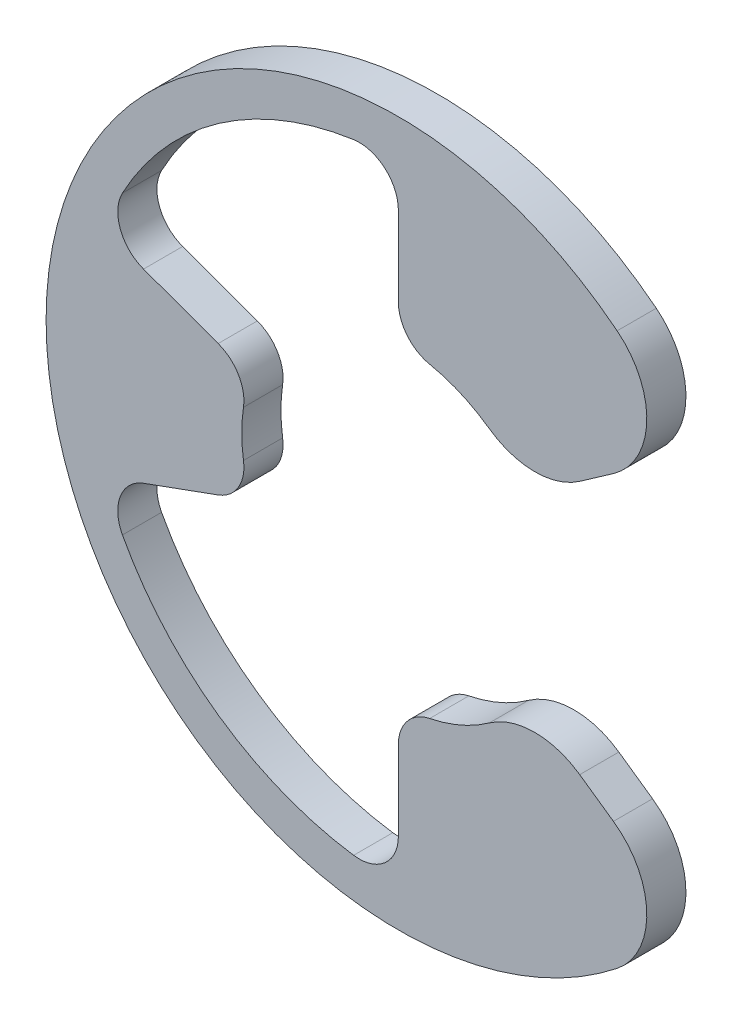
ISO-10303-21;
HEADER;
FILE_DESCRIPTION(('STEP AP214'),'2;1');
FILE_NAME('part.step','',(''),(''),'','','');
FILE_SCHEMA(('AUTOMOTIVE_DESIGN { 1 0 10303 214 1 1 1 1 }'));
ENDSEC;
DATA;
#1=APPLICATION_CONTEXT('core data for automotive mechanical design processes');
#2=APPLICATION_PROTOCOL_DEFINITION('international standard','automotive_design',2000,#1);
#3=PRODUCT_CONTEXT('',#1,'mechanical');
#4=PRODUCT('Part','Part','',(#3));
#5=PRODUCT_RELATED_PRODUCT_CATEGORY('part','',(#4));
#6=PRODUCT_DEFINITION_FORMATION('','',#4);
#7=PRODUCT_DEFINITION_CONTEXT('part definition',#1,'design');
#8=PRODUCT_DEFINITION('design','',#6,#7);
#9=PRODUCT_DEFINITION_SHAPE('','',#8);
#10=(LENGTH_UNIT() NAMED_UNIT(*) SI_UNIT(.MILLI.,.METRE.));
#11=(NAMED_UNIT(*) PLANE_ANGLE_UNIT() SI_UNIT($,.RADIAN.));
#12=(NAMED_UNIT(*) SI_UNIT($,.STERADIAN.) SOLID_ANGLE_UNIT());
#13=UNCERTAINTY_MEASURE_WITH_UNIT(LENGTH_MEASURE(1.E-05),#10,'distance_accuracy_value','');
#14=(GEOMETRIC_REPRESENTATION_CONTEXT(3) GLOBAL_UNCERTAINTY_ASSIGNED_CONTEXT((#13)) GLOBAL_UNIT_ASSIGNED_CONTEXT((#10,
#11,#12)) REPRESENTATION_CONTEXT('',''));
#15=CARTESIAN_POINT('',(0.,0.,0.));
#16=DIRECTION('',(0.,0.,1.));
#17=DIRECTION('',(1.,0.,0.));
#18=AXIS2_PLACEMENT_3D('',#15,#16,#17);
#19=CARTESIAN_POINT('',(-3.08418065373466,1.65463884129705,0.5));
#20=DIRECTION('',(0.,0.,-1.));
#21=DIRECTION('',(-1.,0.,0.));
#22=AXIS2_PLACEMENT_3D('',#19,#20,#21);
#23=CYLINDRICAL_SURFACE('',#22,0.5);
#24=CARTESIAN_POINT('',(-3.08418065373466,1.65463884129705,0.));
#25=DIRECTION('',(0.,0.,-1.));
#26=DIRECTION('',(1.,0.,0.));
#27=AXIS2_PLACEMENT_3D('',#24,#25,#26);
#28=CIRCLE('',#27,0.5);
#29=CARTESIAN_POINT('',(-3.25519072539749,1.1847925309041,0.));
#30=VERTEX_POINT('',#29);
#31=CARTESIAN_POINT('',(-3.52477788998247,1.8910158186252,0.));
#32=VERTEX_POINT('',#31);
#33=EDGE_CURVE('E188',#30,#32,#28,.T.);
#34=ORIENTED_EDGE('',*,*,#33,.T.);
#35=DIRECTION('',(0.,0.,-1.));
#36=VECTOR('',#35,1.);
#37=CARTESIAN_POINT('',(-3.52477788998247,1.8910158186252,0.5));
#38=LINE('',#37,#36);
#39=CARTESIAN_POINT('',(-3.52477788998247,1.8910158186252,0.5));
#40=VERTEX_POINT('',#39);
#41=EDGE_CURVE('E11',#40,#32,#38,.T.);
#42=ORIENTED_EDGE('',*,*,#41,.F.);
#43=CARTESIAN_POINT('',(-3.08418065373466,1.65463884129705,0.5));
#44=DIRECTION('',(0.,0.,-1.));
#45=DIRECTION('',(1.,0.,0.));
#46=AXIS2_PLACEMENT_3D('',#43,#44,#45);
#47=CIRCLE('',#46,0.5);
#48=CARTESIAN_POINT('',(-3.25519072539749,1.1847925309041,0.5));
#49=VERTEX_POINT('',#48);
#50=EDGE_CURVE('E247',#49,#40,#47,.T.);
#51=ORIENTED_EDGE('',*,*,#50,.F.);
#52=DIRECTION('',(0.,0.,-1.));
#53=VECTOR('',#52,1.);
#54=CARTESIAN_POINT('',(-3.25519072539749,1.1847925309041,0.5));
#55=LINE('',#54,#53);
#56=EDGE_CURVE('E201',#49,#30,#55,.T.);
#57=ORIENTED_EDGE('',*,*,#56,.T.);
#58=EDGE_LOOP('',(#34,#42,#51,#57));
#59=FACE_BOUND('',#58,.T.);
#60=ADVANCED_FACE('F24',(#59),#23,.F.);
#61=CARTESIAN_POINT('',(0.,0.,0.5));
#62=DIRECTION('',(0.,0.,-1.));
#63=DIRECTION('',(-1.,0.,0.));
#64=AXIS2_PLACEMENT_3D('',#61,#62,#63);
#65=CYLINDRICAL_SURFACE('',#64,4.);
#66=CARTESIAN_POINT('',(0.,0.,0.));
#67=DIRECTION('',(0.,0.,-1.));
#68=DIRECTION('',(1.,0.,0.));
#69=AXIS2_PLACEMENT_3D('',#66,#67,#68);
#70=CIRCLE('',#69,4.);
#71=CARTESIAN_POINT('',(-0.571428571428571,3.95897327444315,0.));
#72=VERTEX_POINT('',#71);
#73=EDGE_CURVE('E184',#32,#72,#70,.T.);
#74=ORIENTED_EDGE('',*,*,#73,.T.);
#75=DIRECTION('',(0.,0.,-1.));
#76=VECTOR('',#75,1.);
#77=CARTESIAN_POINT('',(-0.571428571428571,3.95897327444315,0.5));
#78=LINE('',#77,#76);
#79=CARTESIAN_POINT('',(-0.571428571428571,3.95897327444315,0.5));
#80=VERTEX_POINT('',#79);
#81=EDGE_CURVE('E31',#80,#72,#78,.T.);
#82=ORIENTED_EDGE('',*,*,#81,.F.);
#83=CARTESIAN_POINT('',(0.,0.,0.5));
#84=DIRECTION('',(0.,0.,-1.));
#85=DIRECTION('',(1.,0.,0.));
#86=AXIS2_PLACEMENT_3D('',#83,#84,#85);
#87=CIRCLE('',#86,4.);
#88=EDGE_CURVE('E197',#40,#80,#87,.T.);
#89=ORIENTED_EDGE('',*,*,#88,.F.);
#90=ORIENTED_EDGE('',*,*,#41,.T.);
#91=EDGE_LOOP('',(#74,#82,#89,#90));
#92=FACE_BOUND('',#91,.T.);
#93=ADVANCED_FACE('F196',(#92),#65,.F.);
#94=CARTESIAN_POINT('',(-0.5,3.46410161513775,0.5));
#95=DIRECTION('',(0.,0.,-1.));
#96=DIRECTION('',(-1.,0.,0.));
#97=AXIS2_PLACEMENT_3D('',#94,#95,#96);
#98=CYLINDRICAL_SURFACE('',#97,0.5);
#99=CARTESIAN_POINT('',(-0.5,3.46410161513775,0.));
#100=DIRECTION('',(0.,0.,-1.));
#101=DIRECTION('',(-1.,0.,0.));
#102=AXIS2_PLACEMENT_3D('',#99,#100,#101);
#103=CIRCLE('',#102,0.5);
#104=CARTESIAN_POINT('',(0.,3.46410161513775,0.));
#105=VERTEX_POINT('',#104);
#106=EDGE_CURVE('E190',#72,#105,#103,.T.);
#107=ORIENTED_EDGE('',*,*,#106,.T.);
#108=DIRECTION('',(0.,0.,-1.));
#109=VECTOR('',#108,1.);
#110=CARTESIAN_POINT('',(0.,3.46410161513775,0.5));
#111=LINE('',#110,#109);
#112=CARTESIAN_POINT('',(0.,3.46410161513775,0.5));
#113=VERTEX_POINT('',#112);
#114=EDGE_CURVE('E353',#113,#105,#111,.T.);
#115=ORIENTED_EDGE('',*,*,#114,.F.);
#116=CARTESIAN_POINT('',(-0.5,3.46410161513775,0.5));
#117=DIRECTION('',(0.,0.,-1.));
#118=DIRECTION('',(-1.,0.,0.));
#119=AXIS2_PLACEMENT_3D('',#116,#117,#118);
#120=CIRCLE('',#119,0.5);
#121=EDGE_CURVE('E250',#80,#113,#120,.T.);
#122=ORIENTED_EDGE('',*,*,#121,.F.);
#123=ORIENTED_EDGE('',*,*,#81,.T.);
#124=EDGE_LOOP('',(#107,#115,#122,#123));
#125=FACE_BOUND('',#124,.T.);
#126=ADVANCED_FACE('F357',(#125),#98,.F.);
#127=CARTESIAN_POINT('',(0.,3.46410161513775,0.5));
#128=DIRECTION('',(1.,0.,0.));
#129=DIRECTION('',(0.,0.,-1.));
#130=AXIS2_PLACEMENT_3D('',#127,#128,#129);
#131=PLANE('',#130);
#132=DIRECTION('',(0.,-1.,0.));
#133=VECTOR('',#132,1.);
#134=CARTESIAN_POINT('',(0.,3.46410161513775,0.));
#135=LINE('',#134,#133);
#136=CARTESIAN_POINT('',(0.,2.44948974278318,0.));
#137=VERTEX_POINT('',#136);
#138=EDGE_CURVE('E205',#105,#137,#135,.T.);
#139=ORIENTED_EDGE('',*,*,#138,.T.);
#140=DIRECTION('',(0.,0.,-1.));
#141=VECTOR('',#140,1.);
#142=CARTESIAN_POINT('',(0.,2.44948974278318,0.5));
#143=LINE('',#142,#141);
#144=CARTESIAN_POINT('',(0.,2.44948974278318,0.5));
#145=VERTEX_POINT('',#144);
#146=EDGE_CURVE('E350',#145,#137,#143,.T.);
#147=ORIENTED_EDGE('',*,*,#146,.F.);
#148=DIRECTION('',(0.,-1.,0.));
#149=VECTOR('',#148,1.);
#150=CARTESIAN_POINT('',(0.,3.46410161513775,0.5));
#151=LINE('',#150,#149);
#152=EDGE_CURVE('E252',#113,#145,#151,.T.);
#153=ORIENTED_EDGE('',*,*,#152,.F.);
#154=ORIENTED_EDGE('',*,*,#114,.T.);
#155=EDGE_LOOP('',(#139,#147,#153,#154));
#156=FACE_BOUND('',#155,.T.);
#157=ADVANCED_FACE('F365',(#156),#131,.F.);
#158=CARTESIAN_POINT('',(0.5,2.44948974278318,0.5));
#159=DIRECTION('',(0.,0.,-1.));
#160=DIRECTION('',(-1.,0.,0.));
#161=AXIS2_PLACEMENT_3D('',#158,#159,#160);
#162=CYLINDRICAL_SURFACE('',#161,0.5);
#163=CARTESIAN_POINT('',(0.5,2.44948974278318,0.));
#164=DIRECTION('',(0.,0.,1.));
#165=DIRECTION('',(-1.,0.,0.));
#166=AXIS2_PLACEMENT_3D('',#163,#164,#165);
#167=CIRCLE('',#166,0.5);
#168=CARTESIAN_POINT('',(0.4,1.95959179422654,0.));
#169=VERTEX_POINT('',#168);
#170=EDGE_CURVE('E207',#137,#169,#167,.T.);
#171=ORIENTED_EDGE('',*,*,#170,.T.);
#172=DIRECTION('',(0.,0.,-1.));
#173=VECTOR('',#172,1.);
#174=CARTESIAN_POINT('',(0.4,1.95959179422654,0.5));
#175=LINE('',#174,#173);
#176=CARTESIAN_POINT('',(0.4,1.95959179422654,0.5));
#177=VERTEX_POINT('',#176);
#178=EDGE_CURVE('E347',#177,#169,#175,.T.);
#179=ORIENTED_EDGE('',*,*,#178,.F.);
#180=CARTESIAN_POINT('',(0.5,2.44948974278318,0.5));
#181=DIRECTION('',(0.,0.,1.));
#182=DIRECTION('',(-1.,0.,0.));
#183=AXIS2_PLACEMENT_3D('',#180,#181,#182);
#184=CIRCLE('',#183,0.5);
#185=EDGE_CURVE('E254',#145,#177,#184,.T.);
#186=ORIENTED_EDGE('',*,*,#185,.F.);
#187=ORIENTED_EDGE('',*,*,#146,.T.);
#188=EDGE_LOOP('',(#171,#179,#186,#187));
#189=FACE_BOUND('',#188,.T.);
#190=ADVANCED_FACE('F368',(#189),#162,.T.);
#191=CARTESIAN_POINT('',(0.,0.,0.5));
#192=DIRECTION('',(0.,0.,-1.));
#193=DIRECTION('',(-1.,0.,0.));
#194=AXIS2_PLACEMENT_3D('',#191,#192,#193);
#195=CYLINDRICAL_SURFACE('',#194,2.);
#196=CARTESIAN_POINT('',(0.,0.,0.));
#197=DIRECTION('',(0.,0.,-1.));
#198=DIRECTION('',(1.,0.,0.));
#199=AXIS2_PLACEMENT_3D('',#196,#197,#198);
#200=CIRCLE('',#199,2.);
#201=CARTESIAN_POINT('',(1.1622236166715,1.62764746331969,0.));
#202=VERTEX_POINT('',#201);
#203=EDGE_CURVE('E209',#169,#202,#200,.T.);
#204=ORIENTED_EDGE('',*,*,#203,.T.);
#205=DIRECTION('',(0.,0.,-1.));
#206=VECTOR('',#205,1.);
#207=CARTESIAN_POINT('',(1.1622236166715,1.62764746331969,0.5));
#208=LINE('',#207,#206);
#209=CARTESIAN_POINT('',(1.1622236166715,1.62764746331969,0.5));
#210=VERTEX_POINT('',#209);
#211=EDGE_CURVE('E344',#210,#202,#208,.T.);
#212=ORIENTED_EDGE('',*,*,#211,.F.);
#213=CARTESIAN_POINT('',(0.,0.,0.5));
#214=DIRECTION('',(0.,0.,-1.));
#215=DIRECTION('',(1.,0.,0.));
#216=AXIS2_PLACEMENT_3D('',#213,#214,#215);
#217=CIRCLE('',#216,2.);
#218=EDGE_CURVE('E256',#177,#210,#217,.T.);
#219=ORIENTED_EDGE('',*,*,#218,.F.);
#220=ORIENTED_EDGE('',*,*,#178,.T.);
#221=EDGE_LOOP('',(#204,#212,#219,#220));
#222=FACE_BOUND('',#221,.T.);
#223=ADVANCED_FACE('F373',(#222),#195,.F.);
#224=CARTESIAN_POINT('',(1.74333542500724,2.44147119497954,0.5));
#225=DIRECTION('',(0.,0.,-1.));
#226=DIRECTION('',(-1.,0.,0.));
#227=AXIS2_PLACEMENT_3D('',#224,#225,#226);
#228=CYLINDRICAL_SURFACE('',#227,1.);
#229=CARTESIAN_POINT('',(1.74333542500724,2.44147119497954,0.));
#230=DIRECTION('',(0.,0.,1.));
#231=DIRECTION('',(1.,0.,0.));
#232=AXIS2_PLACEMENT_3D('',#229,#230,#231);
#233=CIRCLE('',#232,1.);
#234=CARTESIAN_POINT('',(2.31691186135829,1.62231915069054,0.));
#235=VERTEX_POINT('',#234);
#236=EDGE_CURVE('E211',#202,#235,#233,.T.);
#237=ORIENTED_EDGE('',*,*,#236,.T.);
#238=DIRECTION('',(0.,0.,-1.));
#239=VECTOR('',#238,1.);
#240=CARTESIAN_POINT('',(2.31691186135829,1.62231915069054,0.5));
#241=LINE('',#240,#239);
#242=CARTESIAN_POINT('',(2.31691186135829,1.62231915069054,0.5));
#243=VERTEX_POINT('',#242);
#244=EDGE_CURVE('E341',#243,#235,#241,.T.);
#245=ORIENTED_EDGE('',*,*,#244,.F.);
#246=CARTESIAN_POINT('',(1.74333542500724,2.44147119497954,0.5));
#247=DIRECTION('',(0.,0.,1.));
#248=DIRECTION('',(1.,0.,0.));
#249=AXIS2_PLACEMENT_3D('',#246,#247,#248);
#250=CIRCLE('',#249,1.);
#251=EDGE_CURVE('E258',#210,#243,#250,.T.);
#252=ORIENTED_EDGE('',*,*,#251,.F.);
#253=ORIENTED_EDGE('',*,*,#211,.T.);
#254=EDGE_LOOP('',(#237,#245,#252,#253));
#255=FACE_BOUND('',#254,.T.);
#256=ADVANCED_FACE('F379',(#255),#228,.T.);
#257=CARTESIAN_POINT('',(2.31691186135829,1.62231915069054,0.5));
#258=DIRECTION('',(-0.573576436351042,0.819152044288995,0.));
#259=DIRECTION('',(-0.819152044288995,-0.573576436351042,0.));
#260=AXIS2_PLACEMENT_3D('',#257,#258,#259);
#261=PLANE('',#260);
#262=DIRECTION('',(0.819152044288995,0.573576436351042,0.));
#263=VECTOR('',#262,1.);
#264=CARTESIAN_POINT('',(2.31691186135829,1.62231915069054,0.));
#265=LINE('',#264,#263);
#266=CARTESIAN_POINT('',(2.74751948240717,1.92383385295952,0.));
#267=VERTEX_POINT('',#266);
#268=EDGE_CURVE('E213',#235,#267,#265,.T.);
#269=ORIENTED_EDGE('',*,*,#268,.T.);
#270=DIRECTION('',(0.,0.,-1.));
#271=VECTOR('',#270,1.);
#272=CARTESIAN_POINT('',(2.74751948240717,1.92383385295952,0.5));
#273=LINE('',#272,#271);
#274=CARTESIAN_POINT('',(2.74751948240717,1.92383385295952,0.5));
#275=VERTEX_POINT('',#274);
#276=EDGE_CURVE('E338',#275,#267,#273,.T.);
#277=ORIENTED_EDGE('',*,*,#276,.F.);
#278=DIRECTION('',(0.819152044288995,0.573576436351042,0.));
#279=VECTOR('',#278,1.);
#280=CARTESIAN_POINT('',(2.31691186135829,1.62231915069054,0.5));
#281=LINE('',#280,#279);
#282=EDGE_CURVE('E260',#243,#275,#281,.T.);
#283=ORIENTED_EDGE('',*,*,#282,.F.);
#284=ORIENTED_EDGE('',*,*,#244,.T.);
#285=EDGE_LOOP('',(#269,#277,#283,#284));
#286=FACE_BOUND('',#285,.T.);
#287=ADVANCED_FACE('F383',(#286),#261,.F.);
#288=CARTESIAN_POINT('',(2.17394304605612,2.74298589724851,0.5));
#289=DIRECTION('',(0.,0.,-1.));
#290=DIRECTION('',(-1.,0.,0.));
#291=AXIS2_PLACEMENT_3D('',#288,#289,#290);
#292=CYLINDRICAL_SURFACE('',#291,1.);
#293=CARTESIAN_POINT('',(2.17394304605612,2.74298589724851,0.));
#294=DIRECTION('',(0.,0.,1.));
#295=DIRECTION('',(-1.,0.,0.));
#296=AXIS2_PLACEMENT_3D('',#293,#294,#295);
#297=CIRCLE('',#296,1.);
#298=CARTESIAN_POINT('',(2.79506963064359,3.52669615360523,0.));
#299=VERTEX_POINT('',#298);
#300=EDGE_CURVE('E215',#267,#299,#297,.T.);
#301=ORIENTED_EDGE('',*,*,#300,.T.);
#302=DIRECTION('',(0.,0.,-1.));
#303=VECTOR('',#302,1.);
#304=CARTESIAN_POINT('',(2.79506963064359,3.52669615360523,0.5));
#305=LINE('',#304,#303);
#306=CARTESIAN_POINT('',(2.79506963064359,3.52669615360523,0.5));
#307=VERTEX_POINT('',#306);
#308=EDGE_CURVE('E335',#307,#299,#305,.T.);
#309=ORIENTED_EDGE('',*,*,#308,.F.);
#310=CARTESIAN_POINT('',(2.17394304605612,2.74298589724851,0.5));
#311=DIRECTION('',(0.,0.,1.));
#312=DIRECTION('',(-1.,0.,0.));
#313=AXIS2_PLACEMENT_3D('',#310,#311,#312);
#314=CIRCLE('',#313,1.);
#315=EDGE_CURVE('E262',#275,#307,#314,.T.);
#316=ORIENTED_EDGE('',*,*,#315,.F.);
#317=ORIENTED_EDGE('',*,*,#276,.T.);
#318=EDGE_LOOP('',(#301,#309,#316,#317));
#319=FACE_BOUND('',#318,.T.);
#320=ADVANCED_FACE('F388',(#319),#292,.T.);
#321=CARTESIAN_POINT('',(0.,0.,0.5));
#322=DIRECTION('',(0.,0.,-1.));
#323=DIRECTION('',(-1.,0.,0.));
#324=AXIS2_PLACEMENT_3D('',#321,#322,#323);
#325=CYLINDRICAL_SURFACE('',#324,4.5);
#326=CARTESIAN_POINT('',(0.,0.,0.));
#327=DIRECTION('',(0.,0.,1.));
#328=DIRECTION('',(1.,0.,0.));
#329=AXIS2_PLACEMENT_3D('',#326,#327,#328);
#330=CIRCLE('',#329,4.5);
#331=CARTESIAN_POINT('',(2.79506963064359,-3.52669615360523,0.));
#332=VERTEX_POINT('',#331);
#333=EDGE_CURVE('E217',#299,#332,#330,.T.);
#334=ORIENTED_EDGE('',*,*,#333,.T.);
#335=DIRECTION('',(0.,0.,-1.));
#336=VECTOR('',#335,1.);
#337=CARTESIAN_POINT('',(2.79506963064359,-3.52669615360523,0.5));
#338=LINE('',#337,#336);
#339=CARTESIAN_POINT('',(2.79506963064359,-3.52669615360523,0.5));
#340=VERTEX_POINT('',#339);
#341=EDGE_CURVE('E332',#340,#332,#338,.T.);
#342=ORIENTED_EDGE('',*,*,#341,.F.);
#343=CARTESIAN_POINT('',(0.,0.,0.5));
#344=DIRECTION('',(0.,0.,1.));
#345=DIRECTION('',(1.,0.,0.));
#346=AXIS2_PLACEMENT_3D('',#343,#344,#345);
#347=CIRCLE('',#346,4.5);
#348=EDGE_CURVE('E264',#307,#340,#347,.T.);
#349=ORIENTED_EDGE('',*,*,#348,.F.);
#350=ORIENTED_EDGE('',*,*,#308,.T.);
#351=EDGE_LOOP('',(#334,#342,#349,#350));
#352=FACE_BOUND('',#351,.T.);
#353=ADVANCED_FACE('F394',(#352),#325,.T.);
#354=CARTESIAN_POINT('',(2.17394304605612,-2.74298589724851,0.5));
#355=DIRECTION('',(0.,0.,-1.));
#356=DIRECTION('',(-1.,0.,0.));
#357=AXIS2_PLACEMENT_3D('',#354,#355,#356);
#358=CYLINDRICAL_SURFACE('',#357,1.);
#359=CARTESIAN_POINT('',(2.17394304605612,-2.74298589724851,0.));
#360=DIRECTION('',(0.,0.,1.));
#361=DIRECTION('',(1.,0.,0.));
#362=AXIS2_PLACEMENT_3D('',#359,#360,#361);
#363=CIRCLE('',#362,1.);
#364=CARTESIAN_POINT('',(2.74751948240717,-1.92383385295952,0.));
#365=VERTEX_POINT('',#364);
#366=EDGE_CURVE('E219',#332,#365,#363,.T.);
#367=ORIENTED_EDGE('',*,*,#366,.T.);
#368=DIRECTION('',(0.,0.,-1.));
#369=VECTOR('',#368,1.);
#370=CARTESIAN_POINT('',(2.74751948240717,-1.92383385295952,0.5));
#371=LINE('',#370,#369);
#372=CARTESIAN_POINT('',(2.74751948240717,-1.92383385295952,0.5));
#373=VERTEX_POINT('',#372);
#374=EDGE_CURVE('E329',#373,#365,#371,.T.);
#375=ORIENTED_EDGE('',*,*,#374,.F.);
#376=CARTESIAN_POINT('',(2.17394304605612,-2.74298589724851,0.5));
#377=DIRECTION('',(0.,0.,1.));
#378=DIRECTION('',(1.,0.,0.));
#379=AXIS2_PLACEMENT_3D('',#376,#377,#378);
#380=CIRCLE('',#379,1.);
#381=EDGE_CURVE('E266',#340,#373,#380,.T.);
#382=ORIENTED_EDGE('',*,*,#381,.F.);
#383=ORIENTED_EDGE('',*,*,#341,.T.);
#384=EDGE_LOOP('',(#367,#375,#382,#383));
#385=FACE_BOUND('',#384,.T.);
#386=ADVANCED_FACE('F398',(#385),#358,.T.);
#387=CARTESIAN_POINT('',(2.31691186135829,-1.62231915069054,0.5));
#388=DIRECTION('',(-0.573576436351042,-0.819152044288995,0.));
#389=DIRECTION('',(0.819152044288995,-0.573576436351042,0.));
#390=AXIS2_PLACEMENT_3D('',#387,#388,#389);
#391=PLANE('',#390);
#392=DIRECTION('',(-0.819152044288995,0.573576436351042,0.));
#393=VECTOR('',#392,1.);
#394=CARTESIAN_POINT('',(2.31691186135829,-1.62231915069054,0.));
#395=LINE('',#394,#393);
#396=CARTESIAN_POINT('',(2.31691186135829,-1.62231915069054,0.));
#397=VERTEX_POINT('',#396);
#398=EDGE_CURVE('E221',#365,#397,#395,.T.);
#399=ORIENTED_EDGE('',*,*,#398,.T.);
#400=DIRECTION('',(0.,0.,-1.));
#401=VECTOR('',#400,1.);
#402=CARTESIAN_POINT('',(2.31691186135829,-1.62231915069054,0.5));
#403=LINE('',#402,#401);
#404=CARTESIAN_POINT('',(2.31691186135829,-1.62231915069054,0.5));
#405=VERTEX_POINT('',#404);
#406=EDGE_CURVE('E326',#405,#397,#403,.T.);
#407=ORIENTED_EDGE('',*,*,#406,.F.);
#408=DIRECTION('',(-0.819152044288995,0.573576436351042,0.));
#409=VECTOR('',#408,1.);
#410=CARTESIAN_POINT('',(2.31691186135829,-1.62231915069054,0.5));
#411=LINE('',#410,#409);
#412=EDGE_CURVE('E268',#373,#405,#411,.T.);
#413=ORIENTED_EDGE('',*,*,#412,.F.);
#414=ORIENTED_EDGE('',*,*,#374,.T.);
#415=EDGE_LOOP('',(#399,#407,#413,#414));
#416=FACE_BOUND('',#415,.T.);
#417=ADVANCED_FACE('F403',(#416),#391,.F.);
#418=CARTESIAN_POINT('',(1.74333542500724,-2.44147119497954,0.5));
#419=DIRECTION('',(0.,0.,-1.));
#420=DIRECTION('',(-1.,0.,0.));
#421=AXIS2_PLACEMENT_3D('',#418,#419,#420);
#422=CYLINDRICAL_SURFACE('',#421,1.);
#423=CARTESIAN_POINT('',(1.74333542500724,-2.44147119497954,0.));
#424=DIRECTION('',(0.,0.,1.));
#425=DIRECTION('',(-1.,0.,0.));
#426=AXIS2_PLACEMENT_3D('',#423,#424,#425);
#427=CIRCLE('',#426,1.);
#428=CARTESIAN_POINT('',(1.1622236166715,-1.62764746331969,0.));
#429=VERTEX_POINT('',#428);
#430=EDGE_CURVE('E223',#397,#429,#427,.T.);
#431=ORIENTED_EDGE('',*,*,#430,.T.);
#432=DIRECTION('',(0.,0.,-1.));
#433=VECTOR('',#432,1.);
#434=CARTESIAN_POINT('',(1.1622236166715,-1.62764746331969,0.5));
#435=LINE('',#434,#433);
#436=CARTESIAN_POINT('',(1.1622236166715,-1.62764746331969,0.5));
#437=VERTEX_POINT('',#436);
#438=EDGE_CURVE('E323',#437,#429,#435,.T.);
#439=ORIENTED_EDGE('',*,*,#438,.F.);
#440=CARTESIAN_POINT('',(1.74333542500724,-2.44147119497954,0.5));
#441=DIRECTION('',(0.,0.,1.));
#442=DIRECTION('',(-1.,0.,0.));
#443=AXIS2_PLACEMENT_3D('',#440,#441,#442);
#444=CIRCLE('',#443,1.);
#445=EDGE_CURVE('E270',#405,#437,#444,.T.);
#446=ORIENTED_EDGE('',*,*,#445,.F.);
#447=ORIENTED_EDGE('',*,*,#406,.T.);
#448=EDGE_LOOP('',(#431,#439,#446,#447));
#449=FACE_BOUND('',#448,.T.);
#450=ADVANCED_FACE('F409',(#449),#422,.T.);
#451=CARTESIAN_POINT('',(0.,0.,0.5));
#452=DIRECTION('',(0.,0.,-1.));
#453=DIRECTION('',(-1.,0.,0.));
#454=AXIS2_PLACEMENT_3D('',#451,#452,#453);
#455=CYLINDRICAL_SURFACE('',#454,2.);
#456=CARTESIAN_POINT('',(0.,0.,0.));
#457=DIRECTION('',(0.,0.,-1.));
#458=DIRECTION('',(1.,0.,0.));
#459=AXIS2_PLACEMENT_3D('',#456,#457,#458);
#460=CIRCLE('',#459,2.);
#461=CARTESIAN_POINT('',(0.399999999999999,-1.95959179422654,0.));
#462=VERTEX_POINT('',#461);
#463=EDGE_CURVE('E225',#429,#462,#460,.T.);
#464=ORIENTED_EDGE('',*,*,#463,.T.);
#465=DIRECTION('',(0.,0.,-1.));
#466=VECTOR('',#465,1.);
#467=CARTESIAN_POINT('',(0.399999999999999,-1.95959179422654,0.5));
#468=LINE('',#467,#466);
#469=CARTESIAN_POINT('',(0.399999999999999,-1.95959179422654,0.5));
#470=VERTEX_POINT('',#469);
#471=EDGE_CURVE('E320',#470,#462,#468,.T.);
#472=ORIENTED_EDGE('',*,*,#471,.F.);
#473=CARTESIAN_POINT('',(0.,0.,0.5));
#474=DIRECTION('',(0.,0.,-1.));
#475=DIRECTION('',(1.,0.,0.));
#476=AXIS2_PLACEMENT_3D('',#473,#474,#475);
#477=CIRCLE('',#476,2.);
#478=EDGE_CURVE('E272',#437,#470,#477,.T.);
#479=ORIENTED_EDGE('',*,*,#478,.F.);
#480=ORIENTED_EDGE('',*,*,#438,.T.);
#481=EDGE_LOOP('',(#464,#472,#479,#480));
#482=FACE_BOUND('',#481,.T.);
#483=ADVANCED_FACE('F413',(#482),#455,.F.);
#484=CARTESIAN_POINT('',(0.5,-2.44948974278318,0.5));
#485=DIRECTION('',(0.,0.,-1.));
#486=DIRECTION('',(-1.,0.,0.));
#487=AXIS2_PLACEMENT_3D('',#484,#485,#486);
#488=CYLINDRICAL_SURFACE('',#487,0.5);
#489=CARTESIAN_POINT('',(0.5,-2.44948974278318,0.));
#490=DIRECTION('',(0.,0.,1.));
#491=DIRECTION('',(1.,0.,0.));
#492=AXIS2_PLACEMENT_3D('',#489,#490,#491);
#493=CIRCLE('',#492,0.5);
#494=CARTESIAN_POINT('',(0.,-2.44948974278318,0.));
#495=VERTEX_POINT('',#494);
#496=EDGE_CURVE('E227',#462,#495,#493,.T.);
#497=ORIENTED_EDGE('',*,*,#496,.T.);
#498=DIRECTION('',(0.,0.,-1.));
#499=VECTOR('',#498,1.);
#500=CARTESIAN_POINT('',(0.,-2.44948974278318,0.5));
#501=LINE('',#500,#499);
#502=CARTESIAN_POINT('',(0.,-2.44948974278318,0.5));
#503=VERTEX_POINT('',#502);
#504=EDGE_CURVE('E317',#503,#495,#501,.T.);
#505=ORIENTED_EDGE('',*,*,#504,.F.);
#506=CARTESIAN_POINT('',(0.5,-2.44948974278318,0.5));
#507=DIRECTION('',(0.,0.,1.));
#508=DIRECTION('',(1.,0.,0.));
#509=AXIS2_PLACEMENT_3D('',#506,#507,#508);
#510=CIRCLE('',#509,0.5);
#511=EDGE_CURVE('E274',#470,#503,#510,.T.);
#512=ORIENTED_EDGE('',*,*,#511,.F.);
#513=ORIENTED_EDGE('',*,*,#471,.T.);
#514=EDGE_LOOP('',(#497,#505,#512,#513));
#515=FACE_BOUND('',#514,.T.);
#516=ADVANCED_FACE('F418',(#515),#488,.T.);
#517=CARTESIAN_POINT('',(0.,-3.46410161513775,0.5));
#518=DIRECTION('',(1.,0.,0.));
#519=DIRECTION('',(0.,0.,-1.));
#520=AXIS2_PLACEMENT_3D('',#517,#518,#519);
#521=PLANE('',#520);
#522=DIRECTION('',(0.,-1.,0.));
#523=VECTOR('',#522,1.);
#524=CARTESIAN_POINT('',(0.,-3.46410161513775,0.));
#525=LINE('',#524,#523);
#526=CARTESIAN_POINT('',(0.,-3.46410161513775,0.));
#527=VERTEX_POINT('',#526);
#528=EDGE_CURVE('E229',#495,#527,#525,.T.);
#529=ORIENTED_EDGE('',*,*,#528,.T.);
#530=DIRECTION('',(0.,0.,-1.));
#531=VECTOR('',#530,1.);
#532=CARTESIAN_POINT('',(0.,-3.46410161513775,0.5));
#533=LINE('',#532,#531);
#534=CARTESIAN_POINT('',(0.,-3.46410161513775,0.5));
#535=VERTEX_POINT('',#534);
#536=EDGE_CURVE('E314',#535,#527,#533,.T.);
#537=ORIENTED_EDGE('',*,*,#536,.F.);
#538=DIRECTION('',(0.,-1.,0.));
#539=VECTOR('',#538,1.);
#540=CARTESIAN_POINT('',(0.,-3.46410161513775,0.5));
#541=LINE('',#540,#539);
#542=EDGE_CURVE('E276',#503,#535,#541,.T.);
#543=ORIENTED_EDGE('',*,*,#542,.F.);
#544=ORIENTED_EDGE('',*,*,#504,.T.);
#545=EDGE_LOOP('',(#529,#537,#543,#544));
#546=FACE_BOUND('',#545,.T.);
#547=ADVANCED_FACE('F424',(#546),#521,.F.);
#548=CARTESIAN_POINT('',(-0.5,-3.46410161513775,0.5));
#549=DIRECTION('',(0.,0.,-1.));
#550=DIRECTION('',(-1.,0.,0.));
#551=AXIS2_PLACEMENT_3D('',#548,#549,#550);
#552=CYLINDRICAL_SURFACE('',#551,0.5);
#553=CARTESIAN_POINT('',(-0.5,-3.46410161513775,0.));
#554=DIRECTION('',(0.,0.,-1.));
#555=DIRECTION('',(1.,0.,0.));
#556=AXIS2_PLACEMENT_3D('',#553,#554,#555);
#557=CIRCLE('',#556,0.5);
#558=CARTESIAN_POINT('',(-0.571428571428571,-3.95897327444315,0.));
#559=VERTEX_POINT('',#558);
#560=EDGE_CURVE('E231',#527,#559,#557,.T.);
#561=ORIENTED_EDGE('',*,*,#560,.T.);
#562=DIRECTION('',(0.,0.,-1.));
#563=VECTOR('',#562,1.);
#564=CARTESIAN_POINT('',(-0.571428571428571,-3.95897327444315,0.5));
#565=LINE('',#564,#563);
#566=CARTESIAN_POINT('',(-0.571428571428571,-3.95897327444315,0.5));
#567=VERTEX_POINT('',#566);
#568=EDGE_CURVE('E311',#567,#559,#565,.T.);
#569=ORIENTED_EDGE('',*,*,#568,.F.);
#570=CARTESIAN_POINT('',(-0.5,-3.46410161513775,0.5));
#571=DIRECTION('',(0.,0.,-1.));
#572=DIRECTION('',(1.,0.,0.));
#573=AXIS2_PLACEMENT_3D('',#570,#571,#572);
#574=CIRCLE('',#573,0.5);
#575=EDGE_CURVE('E278',#535,#567,#574,.T.);
#576=ORIENTED_EDGE('',*,*,#575,.F.);
#577=ORIENTED_EDGE('',*,*,#536,.T.);
#578=EDGE_LOOP('',(#561,#569,#576,#577));
#579=FACE_BOUND('',#578,.T.);
#580=ADVANCED_FACE('F428',(#579),#552,.F.);
#581=CARTESIAN_POINT('',(0.,0.,0.5));
#582=DIRECTION('',(0.,0.,-1.));
#583=DIRECTION('',(-1.,0.,0.));
#584=AXIS2_PLACEMENT_3D('',#581,#582,#583);
#585=CYLINDRICAL_SURFACE('',#584,4.);
#586=CARTESIAN_POINT('',(0.,0.,0.));
#587=DIRECTION('',(0.,0.,-1.));
#588=DIRECTION('',(1.,0.,0.));
#589=AXIS2_PLACEMENT_3D('',#586,#587,#588);
#590=CIRCLE('',#589,4.);
#591=CARTESIAN_POINT('',(-3.52477788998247,-1.8910158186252,0.));
#592=VERTEX_POINT('',#591);
#593=EDGE_CURVE('E233',#559,#592,#590,.T.);
#594=ORIENTED_EDGE('',*,*,#593,.T.);
#595=DIRECTION('',(0.,0.,-1.));
#596=VECTOR('',#595,1.);
#597=CARTESIAN_POINT('',(-3.52477788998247,-1.8910158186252,0.5));
#598=LINE('',#597,#596);
#599=CARTESIAN_POINT('',(-3.52477788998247,-1.8910158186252,0.5));
#600=VERTEX_POINT('',#599);
#601=EDGE_CURVE('E308',#600,#592,#598,.T.);
#602=ORIENTED_EDGE('',*,*,#601,.F.);
#603=CARTESIAN_POINT('',(0.,0.,0.5));
#604=DIRECTION('',(0.,0.,-1.));
#605=DIRECTION('',(1.,0.,0.));
#606=AXIS2_PLACEMENT_3D('',#603,#604,#605);
#607=CIRCLE('',#606,4.);
#608=EDGE_CURVE('E280',#567,#600,#607,.T.);
#609=ORIENTED_EDGE('',*,*,#608,.F.);
#610=ORIENTED_EDGE('',*,*,#568,.T.);
#611=EDGE_LOOP('',(#594,#602,#609,#610));
#612=FACE_BOUND('',#611,.T.);
#613=ADVANCED_FACE('F433',(#612),#585,.F.);
#614=CARTESIAN_POINT('',(-3.08418065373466,-1.65463884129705,0.5));
#615=DIRECTION('',(0.,0.,-1.));
#616=DIRECTION('',(-1.,0.,0.));
#617=AXIS2_PLACEMENT_3D('',#614,#615,#616);
#618=CYLINDRICAL_SURFACE('',#617,0.5);
#619=CARTESIAN_POINT('',(-3.08418065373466,-1.65463884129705,0.));
#620=DIRECTION('',(0.,0.,-1.));
#621=DIRECTION('',(-1.,0.,0.));
#622=AXIS2_PLACEMENT_3D('',#619,#620,#621);
#623=CIRCLE('',#622,0.5);
#624=CARTESIAN_POINT('',(-3.25519072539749,-1.1847925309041,0.));
#625=VERTEX_POINT('',#624);
#626=EDGE_CURVE('E235',#592,#625,#623,.T.);
#627=ORIENTED_EDGE('',*,*,#626,.T.);
#628=DIRECTION('',(0.,0.,-1.));
#629=VECTOR('',#628,1.);
#630=CARTESIAN_POINT('',(-3.25519072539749,-1.1847925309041,0.5));
#631=LINE('',#630,#629);
#632=CARTESIAN_POINT('',(-3.25519072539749,-1.1847925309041,0.5));
#633=VERTEX_POINT('',#632);
#634=EDGE_CURVE('E305',#633,#625,#631,.T.);
#635=ORIENTED_EDGE('',*,*,#634,.F.);
#636=CARTESIAN_POINT('',(-3.08418065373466,-1.65463884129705,0.5));
#637=DIRECTION('',(0.,0.,-1.));
#638=DIRECTION('',(-1.,0.,0.));
#639=AXIS2_PLACEMENT_3D('',#636,#637,#638);
#640=CIRCLE('',#639,0.5);
#641=EDGE_CURVE('E282',#600,#633,#640,.T.);
#642=ORIENTED_EDGE('',*,*,#641,.F.);
#643=ORIENTED_EDGE('',*,*,#601,.T.);
#644=EDGE_LOOP('',(#627,#635,#642,#643));
#645=FACE_BOUND('',#644,.T.);
#646=ADVANCED_FACE('F439',(#645),#618,.F.);
#647=CARTESIAN_POINT('',(-2.30176743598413,-0.837774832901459,0.5));
#648=DIRECTION('',(-0.342020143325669,0.939692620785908,0.));
#649=DIRECTION('',(-0.939692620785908,-0.342020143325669,0.));
#650=AXIS2_PLACEMENT_3D('',#647,#648,#649);
#651=PLANE('',#650);
#652=DIRECTION('',(0.939692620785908,0.342020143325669,0.));
#653=VECTOR('',#652,1.);
#654=CARTESIAN_POINT('',(-2.30176743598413,-0.837774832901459,0.));
#655=LINE('',#654,#653);
#656=CARTESIAN_POINT('',(-2.30176743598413,-0.837774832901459,0.));
#657=VERTEX_POINT('',#656);
#658=EDGE_CURVE('E237',#625,#657,#655,.T.);
#659=ORIENTED_EDGE('',*,*,#658,.T.);
#660=DIRECTION('',(0.,0.,-1.));
#661=VECTOR('',#660,1.);
#662=CARTESIAN_POINT('',(-2.30176743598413,-0.837774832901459,0.5));
#663=LINE('',#662,#661);
#664=CARTESIAN_POINT('',(-2.30176743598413,-0.837774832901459,0.5));
#665=VERTEX_POINT('',#664);
#666=EDGE_CURVE('E302',#665,#657,#663,.T.);
#667=ORIENTED_EDGE('',*,*,#666,.F.);
#668=DIRECTION('',(0.939692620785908,0.342020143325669,0.));
#669=VECTOR('',#668,1.);
#670=CARTESIAN_POINT('',(-2.30176743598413,-0.837774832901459,0.5));
#671=LINE('',#670,#669);
#672=EDGE_CURVE('E284',#633,#665,#671,.T.);
#673=ORIENTED_EDGE('',*,*,#672,.F.);
#674=ORIENTED_EDGE('',*,*,#634,.T.);
#675=EDGE_LOOP('',(#659,#667,#673,#674));
#676=FACE_BOUND('',#675,.T.);
#677=ADVANCED_FACE('F443',(#676),#651,.F.);
#678=CARTESIAN_POINT('',(-2.47277750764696,-0.367928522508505,0.5));
#679=DIRECTION('',(0.,0.,-1.));
#680=DIRECTION('',(-1.,0.,0.));
#681=AXIS2_PLACEMENT_3D('',#678,#679,#680);
#682=CYLINDRICAL_SURFACE('',#681,0.5);
#683=CARTESIAN_POINT('',(-2.47277750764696,-0.367928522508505,0.));
#684=DIRECTION('',(0.,0.,1.));
#685=DIRECTION('',(-1.,0.,0.));
#686=AXIS2_PLACEMENT_3D('',#683,#684,#685);
#687=CIRCLE('',#686,0.5);
#688=CARTESIAN_POINT('',(-1.97822200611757,-0.294342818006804,0.));
#689=VERTEX_POINT('',#688);
#690=EDGE_CURVE('E239',#657,#689,#687,.T.);
#691=ORIENTED_EDGE('',*,*,#690,.T.);
#692=DIRECTION('',(0.,0.,-1.));
#693=VECTOR('',#692,1.);
#694=CARTESIAN_POINT('',(-1.97822200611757,-0.294342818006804,0.5));
#695=LINE('',#694,#693);
#696=CARTESIAN_POINT('',(-1.97822200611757,-0.294342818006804,0.5));
#697=VERTEX_POINT('',#696);
#698=EDGE_CURVE('E299',#697,#689,#695,.T.);
#699=ORIENTED_EDGE('',*,*,#698,.F.);
#700=CARTESIAN_POINT('',(-2.47277750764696,-0.367928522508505,0.5));
#701=DIRECTION('',(0.,0.,1.));
#702=DIRECTION('',(-1.,0.,0.));
#703=AXIS2_PLACEMENT_3D('',#700,#701,#702);
#704=CIRCLE('',#703,0.5);
#705=EDGE_CURVE('E286',#665,#697,#704,.T.);
#706=ORIENTED_EDGE('',*,*,#705,.F.);
#707=ORIENTED_EDGE('',*,*,#666,.T.);
#708=EDGE_LOOP('',(#691,#699,#706,#707));
#709=FACE_BOUND('',#708,.T.);
#710=ADVANCED_FACE('F448',(#709),#682,.T.);
#711=CARTESIAN_POINT('',(0.,0.,0.5));
#712=DIRECTION('',(0.,0.,-1.));
#713=DIRECTION('',(-1.,0.,0.));
#714=AXIS2_PLACEMENT_3D('',#711,#712,#713);
#715=CYLINDRICAL_SURFACE('',#714,2.);
#716=CARTESIAN_POINT('',(0.,0.,0.));
#717=DIRECTION('',(0.,0.,-1.));
#718=DIRECTION('',(1.,0.,0.));
#719=AXIS2_PLACEMENT_3D('',#716,#717,#718);
#720=CIRCLE('',#719,2.);
#721=CARTESIAN_POINT('',(-1.97822200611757,0.294342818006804,0.));
#722=VERTEX_POINT('',#721);
#723=EDGE_CURVE('E241',#689,#722,#720,.T.);
#724=ORIENTED_EDGE('',*,*,#723,.T.);
#725=DIRECTION('',(0.,0.,-1.));
#726=VECTOR('',#725,1.);
#727=CARTESIAN_POINT('',(-1.97822200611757,0.294342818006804,0.5));
#728=LINE('',#727,#726);
#729=CARTESIAN_POINT('',(-1.97822200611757,0.294342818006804,0.5));
#730=VERTEX_POINT('',#729);
#731=EDGE_CURVE('E296',#730,#722,#728,.T.);
#732=ORIENTED_EDGE('',*,*,#731,.F.);
#733=CARTESIAN_POINT('',(0.,0.,0.5));
#734=DIRECTION('',(0.,0.,-1.));
#735=DIRECTION('',(1.,0.,0.));
#736=AXIS2_PLACEMENT_3D('',#733,#734,#735);
#737=CIRCLE('',#736,2.);
#738=EDGE_CURVE('E288',#697,#730,#737,.T.);
#739=ORIENTED_EDGE('',*,*,#738,.F.);
#740=ORIENTED_EDGE('',*,*,#698,.T.);
#741=EDGE_LOOP('',(#724,#732,#739,#740));
#742=FACE_BOUND('',#741,.T.);
#743=ADVANCED_FACE('F452',(#742),#715,.F.);
#744=CARTESIAN_POINT('',(-2.47277750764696,0.367928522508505,0.5));
#745=DIRECTION('',(0.,0.,-1.));
#746=DIRECTION('',(-1.,0.,0.));
#747=AXIS2_PLACEMENT_3D('',#744,#745,#746);
#748=CYLINDRICAL_SURFACE('',#747,0.5);
#749=CARTESIAN_POINT('',(-2.47277750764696,0.367928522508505,0.));
#750=DIRECTION('',(0.,0.,1.));
#751=DIRECTION('',(1.,0.,0.));
#752=AXIS2_PLACEMENT_3D('',#749,#750,#751);
#753=CIRCLE('',#752,0.5);
#754=CARTESIAN_POINT('',(-2.30176743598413,0.837774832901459,0.));
#755=VERTEX_POINT('',#754);
#756=EDGE_CURVE('E243',#722,#755,#753,.T.);
#757=ORIENTED_EDGE('',*,*,#756,.T.);
#758=DIRECTION('',(0.,0.,-1.));
#759=VECTOR('',#758,1.);
#760=CARTESIAN_POINT('',(-2.30176743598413,0.837774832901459,0.5));
#761=LINE('',#760,#759);
#762=CARTESIAN_POINT('',(-2.30176743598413,0.837774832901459,0.5));
#763=VERTEX_POINT('',#762);
#764=EDGE_CURVE('E293',#763,#755,#761,.T.);
#765=ORIENTED_EDGE('',*,*,#764,.F.);
#766=CARTESIAN_POINT('',(-2.47277750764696,0.367928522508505,0.5));
#767=DIRECTION('',(0.,0.,1.));
#768=DIRECTION('',(1.,0.,0.));
#769=AXIS2_PLACEMENT_3D('',#766,#767,#768);
#770=CIRCLE('',#769,0.5);
#771=EDGE_CURVE('E43',#730,#763,#770,.T.);
#772=ORIENTED_EDGE('',*,*,#771,.F.);
#773=ORIENTED_EDGE('',*,*,#731,.T.);
#774=EDGE_LOOP('',(#757,#765,#772,#773));
#775=FACE_BOUND('',#774,.T.);
#776=ADVANCED_FACE('F456',(#775),#748,.T.);
#777=CARTESIAN_POINT('',(-2.30176743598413,0.837774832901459,0.5));
#778=DIRECTION('',(-0.342020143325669,-0.939692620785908,0.));
#779=DIRECTION('',(0.939692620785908,-0.342020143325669,0.));
#780=AXIS2_PLACEMENT_3D('',#777,#778,#779);
#781=PLANE('',#780);
#782=DIRECTION('',(-0.939692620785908,0.342020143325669,0.));
#783=VECTOR('',#782,1.);
#784=CARTESIAN_POINT('',(-2.30176743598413,0.837774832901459,0.));
#785=LINE('',#784,#783);
#786=EDGE_CURVE('E245',#755,#30,#785,.T.);
#787=ORIENTED_EDGE('',*,*,#786,.T.);
#788=ORIENTED_EDGE('',*,*,#56,.F.);
#789=DIRECTION('',(-0.939692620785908,0.342020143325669,0.));
#790=VECTOR('',#789,1.);
#791=CARTESIAN_POINT('',(-2.30176743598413,0.837774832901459,0.5));
#792=LINE('',#791,#790);
#793=EDGE_CURVE('E38',#763,#49,#792,.T.);
#794=ORIENTED_EDGE('',*,*,#793,.F.);
#795=ORIENTED_EDGE('',*,*,#764,.T.);
#796=EDGE_LOOP('',(#787,#788,#794,#795));
#797=FACE_BOUND('',#796,.T.);
#798=ADVANCED_FACE('F458',(#797),#781,.F.);
#799=CARTESIAN_POINT('',(-3.08418065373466,1.65463884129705,0.5));
#800=DIRECTION('',(0.,0.,1.));
#801=DIRECTION('',(1.,0.,0.));
#802=AXIS2_PLACEMENT_3D('',#799,#800,#801);
#803=PLANE('',#802);
#804=ORIENTED_EDGE('',*,*,#50,.T.);
#805=ORIENTED_EDGE('',*,*,#88,.T.);
#806=ORIENTED_EDGE('',*,*,#121,.T.);
#807=ORIENTED_EDGE('',*,*,#152,.T.);
#808=ORIENTED_EDGE('',*,*,#185,.T.);
#809=ORIENTED_EDGE('',*,*,#218,.T.);
#810=ORIENTED_EDGE('',*,*,#251,.T.);
#811=ORIENTED_EDGE('',*,*,#282,.T.);
#812=ORIENTED_EDGE('',*,*,#315,.T.);
#813=ORIENTED_EDGE('',*,*,#348,.T.);
#814=ORIENTED_EDGE('',*,*,#381,.T.);
#815=ORIENTED_EDGE('',*,*,#412,.T.);
#816=ORIENTED_EDGE('',*,*,#445,.T.);
#817=ORIENTED_EDGE('',*,*,#478,.T.);
#818=ORIENTED_EDGE('',*,*,#511,.T.);
#819=ORIENTED_EDGE('',*,*,#542,.T.);
#820=ORIENTED_EDGE('',*,*,#575,.T.);
#821=ORIENTED_EDGE('',*,*,#608,.T.);
#822=ORIENTED_EDGE('',*,*,#641,.T.);
#823=ORIENTED_EDGE('',*,*,#672,.T.);
#824=ORIENTED_EDGE('',*,*,#705,.T.);
#825=ORIENTED_EDGE('',*,*,#738,.T.);
#826=ORIENTED_EDGE('',*,*,#771,.T.);
#827=ORIENTED_EDGE('',*,*,#793,.T.);
#828=EDGE_LOOP('',(#804,#805,#806,#807,#808,#809,#810,#811,#812,#813,#814,#815,#816,#817,#818,
#819,#820,#821,#822,#823,#824,#825,#826,#827));
#829=FACE_BOUND('',#828,.T.);
#830=ADVANCED_FACE('F360',(#829),#803,.T.);
#831=CARTESIAN_POINT('',(-3.08418065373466,1.65463884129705,0.));
#832=DIRECTION('',(0.,0.,1.));
#833=DIRECTION('',(1.,0.,0.));
#834=AXIS2_PLACEMENT_3D('',#831,#832,#833);
#835=PLANE('',#834);
#836=ORIENTED_EDGE('',*,*,#33,.F.);
#837=ORIENTED_EDGE('',*,*,#786,.F.);
#838=ORIENTED_EDGE('',*,*,#756,.F.);
#839=ORIENTED_EDGE('',*,*,#723,.F.);
#840=ORIENTED_EDGE('',*,*,#690,.F.);
#841=ORIENTED_EDGE('',*,*,#658,.F.);
#842=ORIENTED_EDGE('',*,*,#626,.F.);
#843=ORIENTED_EDGE('',*,*,#593,.F.);
#844=ORIENTED_EDGE('',*,*,#560,.F.);
#845=ORIENTED_EDGE('',*,*,#528,.F.);
#846=ORIENTED_EDGE('',*,*,#496,.F.);
#847=ORIENTED_EDGE('',*,*,#463,.F.);
#848=ORIENTED_EDGE('',*,*,#430,.F.);
#849=ORIENTED_EDGE('',*,*,#398,.F.);
#850=ORIENTED_EDGE('',*,*,#366,.F.);
#851=ORIENTED_EDGE('',*,*,#333,.F.);
#852=ORIENTED_EDGE('',*,*,#300,.F.);
#853=ORIENTED_EDGE('',*,*,#268,.F.);
#854=ORIENTED_EDGE('',*,*,#236,.F.);
#855=ORIENTED_EDGE('',*,*,#203,.F.);
#856=ORIENTED_EDGE('',*,*,#170,.F.);
#857=ORIENTED_EDGE('',*,*,#138,.F.);
#858=ORIENTED_EDGE('',*,*,#106,.F.);
#859=ORIENTED_EDGE('',*,*,#73,.F.);
#860=EDGE_LOOP('',(#836,#837,#838,#839,#840,#841,#842,#843,#844,#845,#846,#847,#848,#849,#850,
#851,#852,#853,#854,#855,#856,#857,#858,#859));
#861=FACE_BOUND('',#860,.T.);
#862=ADVANCED_FACE('F185',(#861),#835,.F.);
#863=CLOSED_SHELL('',(#60,#93,#126,#157,#190,#223,#256,#287,#320,#353,#386,#417,#450,#483,#516,
#547,#580,#613,#646,#677,#710,#743,#776,#798,#830,#862));
#864=MANIFOLD_SOLID_BREP('B2',#863);
#865=ADVANCED_BREP_SHAPE_REPRESENTATION('',(#18,#864),#14);
#866=SHAPE_DEFINITION_REPRESENTATION(#9,#865);
ENDSEC;
END-ISO-10303-21;
